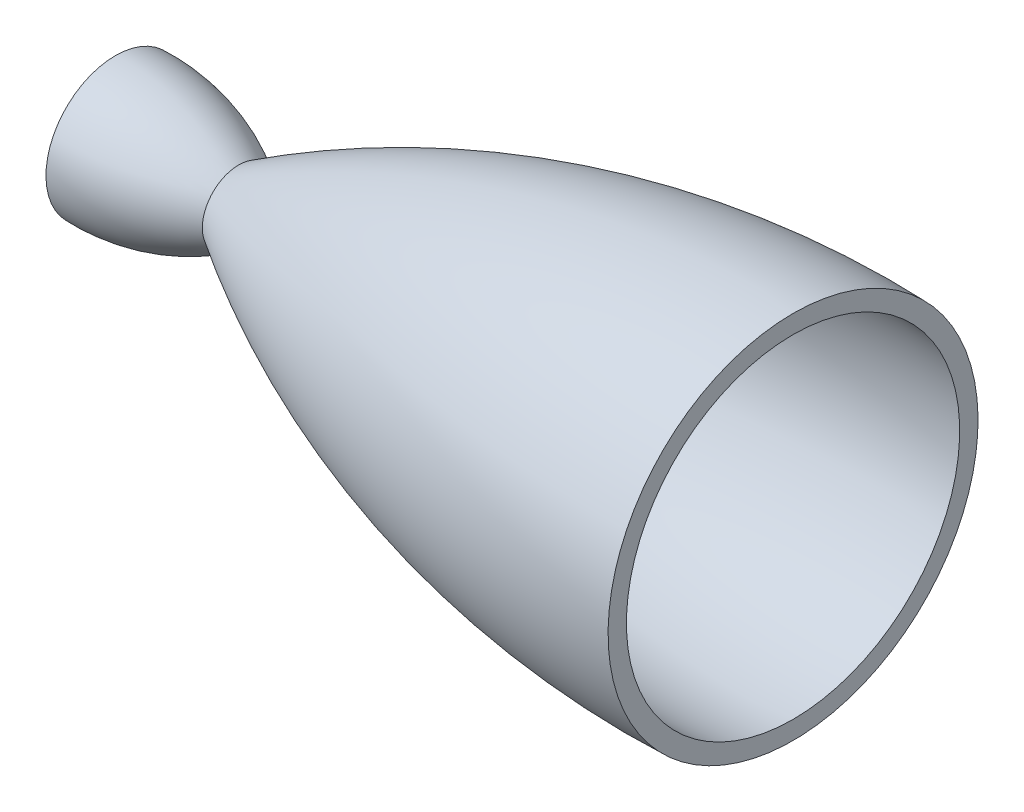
ISO-10303-21;
HEADER;
FILE_DESCRIPTION(('STEP AP214'),'2;1');
FILE_NAME('part.step','',(''),(''),'','','');
FILE_SCHEMA(('AUTOMOTIVE_DESIGN { 1 0 10303 214 1 1 1 1 }'));
ENDSEC;
DATA;
#1=APPLICATION_CONTEXT('core data for automotive mechanical design processes');
#2=APPLICATION_PROTOCOL_DEFINITION('international standard','automotive_design',2000,#1);
#3=PRODUCT_CONTEXT('',#1,'mechanical');
#4=PRODUCT('Part','Part','',(#3));
#5=PRODUCT_RELATED_PRODUCT_CATEGORY('part','',(#4));
#6=PRODUCT_DEFINITION_FORMATION('','',#4);
#7=PRODUCT_DEFINITION_CONTEXT('part definition',#1,'design');
#8=PRODUCT_DEFINITION('design','',#6,#7);
#9=PRODUCT_DEFINITION_SHAPE('','',#8);
#10=(LENGTH_UNIT() NAMED_UNIT(*) SI_UNIT(.MILLI.,.METRE.));
#11=(NAMED_UNIT(*) PLANE_ANGLE_UNIT() SI_UNIT($,.RADIAN.));
#12=(NAMED_UNIT(*) SI_UNIT($,.STERADIAN.) SOLID_ANGLE_UNIT());
#13=UNCERTAINTY_MEASURE_WITH_UNIT(LENGTH_MEASURE(1.E-05),#10,'distance_accuracy_value','');
#14=(GEOMETRIC_REPRESENTATION_CONTEXT(3) GLOBAL_UNCERTAINTY_ASSIGNED_CONTEXT((#13)) GLOBAL_UNIT_ASSIGNED_CONTEXT((#10,
#11,#12)) REPRESENTATION_CONTEXT('',''));
#15=CARTESIAN_POINT('',(0.,0.,0.));
#16=DIRECTION('',(0.,0.,1.));
#17=DIRECTION('',(1.,0.,0.));
#18=AXIS2_PLACEMENT_3D('',#15,#16,#17);
#19=CARTESIAN_POINT('',(285.342334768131,-9.79999999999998,0.));
#20=DIRECTION('',(1.,0.,0.));
#21=DIRECTION('',(0.,1.,0.));
#22=AXIS2_PLACEMENT_3D('',#19,#20,#21);
#23=DEGENERATE_TOROIDAL_SURFACE('',#22,440.560670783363,541.619973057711,.F.);
#24=CARTESIAN_POINT('',(302.1,-9.8,0.));
#25=DIRECTION('',(1.,0.,0.));
#26=DIRECTION('',(0.,1.,0.));
#27=AXIS2_PLACEMENT_3D('',#24,#25,#26);
#28=CIRCLE('',#27,100.8);
#29=CARTESIAN_POINT('',(302.1,91.,0.));
#30=VERTEX_POINT('',#29);
#31=EDGE_CURVE('E72',#30,#30,#28,.T.);
#32=ORIENTED_EDGE('',*,*,#31,.F.);
#33=EDGE_LOOP('',(#32));
#34=FACE_BOUND('',#33,.T.);
#35=CARTESIAN_POINT('',(0.,-9.8,0.));
#36=DIRECTION('',(1.,0.,0.));
#37=DIRECTION('',(0.,1.,0.));
#38=AXIS2_PLACEMENT_3D('',#35,#36,#37);
#39=CIRCLE('',#38,19.8);
#40=CARTESIAN_POINT('',(0.,9.99999999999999,0.));
#41=VERTEX_POINT('',#40);
#42=EDGE_CURVE('E10',#41,#41,#39,.T.);
#43=ORIENTED_EDGE('',*,*,#42,.T.);
#44=EDGE_LOOP('',(#43));
#45=FACE_BOUND('',#44,.T.);
#46=ADVANCED_FACE('F45',(#34,#45),#23,.F.);
#47=CARTESIAN_POINT('',(-63.1292498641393,-9.8,0.));
#48=DIRECTION('',(1.,0.,0.));
#49=DIRECTION('',(0.,1.,0.));
#50=AXIS2_PLACEMENT_3D('',#47,#48,#49);
#51=DEGENERATE_TOROIDAL_SURFACE('',#50,81.4425328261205,119.311997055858,.F.);
#52=ORIENTED_EDGE('',*,*,#42,.F.);
#53=EDGE_LOOP('',(#52));
#54=FACE_BOUND('',#53,.T.);
#55=CARTESIAN_POINT('',(-67.2,-9.8,0.));
#56=DIRECTION('',(1.,0.,0.));
#57=DIRECTION('',(0.,1.,0.));
#58=AXIS2_PLACEMENT_3D('',#55,#56,#57);
#59=CIRCLE('',#58,37.7999999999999);
#60=CARTESIAN_POINT('',(-67.2,27.9999999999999,0.));
#61=VERTEX_POINT('',#60);
#62=EDGE_CURVE('E52',#61,#61,#59,.T.);
#63=ORIENTED_EDGE('',*,*,#62,.T.);
#64=EDGE_LOOP('',(#63));
#65=FACE_BOUND('',#64,.T.);
#66=ADVANCED_FACE('F81',(#54,#65),#51,.F.);
#67=CARTESIAN_POINT('',(-67.2,0.,0.));
#68=DIRECTION('',(1.,0.,0.));
#69=DIRECTION('',(0.,1.,0.));
#70=AXIS2_PLACEMENT_3D('',#67,#68,#69);
#71=PLANE('',#70);
#72=ORIENTED_EDGE('',*,*,#62,.F.);
#73=EDGE_LOOP('',(#72));
#74=FACE_BOUND('',#73,.T.);
#75=CARTESIAN_POINT('',(-67.2,-9.8,0.));
#76=DIRECTION('',(1.,0.,0.));
#77=DIRECTION('',(0.,1.,0.));
#78=AXIS2_PLACEMENT_3D('',#75,#76,#77);
#79=CIRCLE('',#78,27.8);
#80=CARTESIAN_POINT('',(-67.2,18.,0.));
#81=VERTEX_POINT('',#80);
#82=EDGE_CURVE('E57',#81,#81,#79,.T.);
#83=ORIENTED_EDGE('',*,*,#82,.T.);
#84=EDGE_LOOP('',(#83));
#85=FACE_BOUND('',#84,.T.);
#86=ADVANCED_FACE('F85',(#74,#85),#71,.F.);
#87=CARTESIAN_POINT('',(-61.7564981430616,-9.8,0.));
#88=DIRECTION('',(1.,0.,0.));
#89=DIRECTION('',(0.,1.,0.));
#90=AXIS2_PLACEMENT_3D('',#87,#88,#89);
#91=DEGENERATE_TOROIDAL_SURFACE('',#90,86.31759306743,114.247349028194,.F.);
#92=CARTESIAN_POINT('',(0.,-9.8,0.));
#93=DIRECTION('',(1.,0.,0.));
#94=DIRECTION('',(0.,1.,0.));
#95=AXIS2_PLACEMENT_3D('',#92,#93,#94);
#96=CIRCLE('',#95,9.8);
#97=CARTESIAN_POINT('',(0.,0.,0.));
#98=VERTEX_POINT('',#97);
#99=EDGE_CURVE('E62',#98,#98,#96,.T.);
#100=ORIENTED_EDGE('',*,*,#99,.T.);
#101=EDGE_LOOP('',(#100));
#102=FACE_BOUND('',#101,.T.);
#103=ORIENTED_EDGE('',*,*,#82,.F.);
#104=EDGE_LOOP('',(#103));
#105=FACE_BOUND('',#104,.T.);
#106=ADVANCED_FACE('F90',(#102,#105),#91,.T.);
#107=CARTESIAN_POINT('',(283.970040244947,-9.79999999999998,0.));
#108=DIRECTION('',(1.,0.,0.));
#109=DIRECTION('',(0.,1.,0.));
#110=AXIS2_PLACEMENT_3D('',#107,#108,#109);
#111=DEGENERATE_TOROIDAL_SURFACE('',#110,445.442520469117,536.548913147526,.F.);
#112=CARTESIAN_POINT('',(302.1,-9.8,0.));
#113=DIRECTION('',(1.,0.,0.));
#114=DIRECTION('',(0.,1.,0.));
#115=AXIS2_PLACEMENT_3D('',#112,#113,#114);
#116=CIRCLE('',#115,90.8);
#117=CARTESIAN_POINT('',(302.1,81.,0.));
#118=VERTEX_POINT('',#117);
#119=EDGE_CURVE('E68',#118,#118,#116,.T.);
#120=ORIENTED_EDGE('',*,*,#119,.T.);
#121=EDGE_LOOP('',(#120));
#122=FACE_BOUND('',#121,.T.);
#123=ORIENTED_EDGE('',*,*,#99,.F.);
#124=EDGE_LOOP('',(#123));
#125=FACE_BOUND('',#124,.T.);
#126=ADVANCED_FACE('F96',(#122,#125),#111,.T.);
#127=CARTESIAN_POINT('',(302.1,0.,0.));
#128=DIRECTION('',(1.,0.,0.));
#129=DIRECTION('',(0.,1.,0.));
#130=AXIS2_PLACEMENT_3D('',#127,#128,#129);
#131=PLANE('',#130);
#132=ORIENTED_EDGE('',*,*,#31,.T.);
#133=EDGE_LOOP('',(#132));
#134=FACE_BOUND('',#133,.T.);
#135=ORIENTED_EDGE('',*,*,#119,.F.);
#136=EDGE_LOOP('',(#135));
#137=FACE_BOUND('',#136,.T.);
#138=ADVANCED_FACE('F77',(#134,#137),#131,.T.);
#139=CLOSED_SHELL('',(#46,#66,#86,#106,#126,#138));
#140=MANIFOLD_SOLID_BREP('B2',#139);
#141=ADVANCED_BREP_SHAPE_REPRESENTATION('',(#18,#140),#14);
#142=SHAPE_DEFINITION_REPRESENTATION(#9,#141);
ENDSEC;
END-ISO-10303-21;
